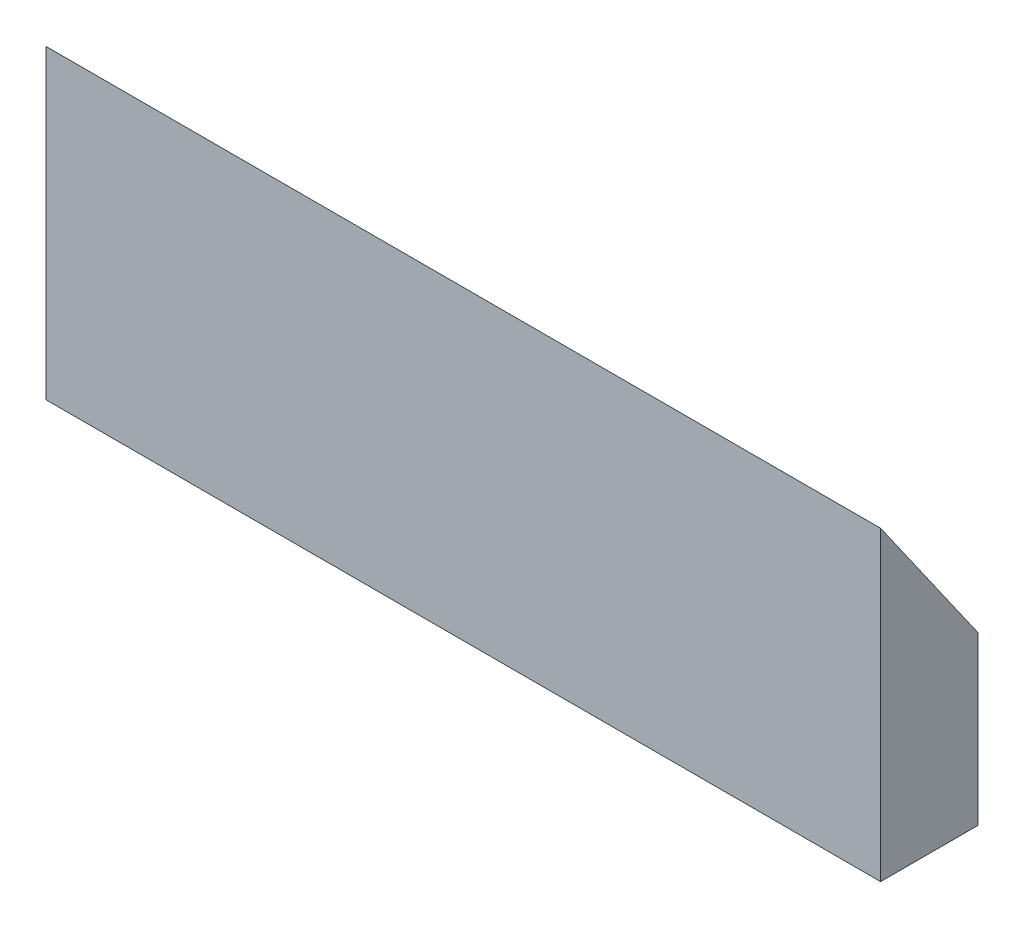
ISO-10303-21;
HEADER;
FILE_DESCRIPTION(('STEP AP214'),'2;1');
FILE_NAME('part.step','',(''),(''),'','','');
FILE_SCHEMA(('AUTOMOTIVE_DESIGN { 1 0 10303 214 1 1 1 1 }'));
ENDSEC;
DATA;
#1=APPLICATION_CONTEXT('core data for automotive mechanical design processes');
#2=APPLICATION_PROTOCOL_DEFINITION('international standard','automotive_design',2000,#1);
#3=PRODUCT_CONTEXT('',#1,'mechanical');
#4=PRODUCT('Part','Part','',(#3));
#5=PRODUCT_RELATED_PRODUCT_CATEGORY('part','',(#4));
#6=PRODUCT_DEFINITION_FORMATION('','',#4);
#7=PRODUCT_DEFINITION_CONTEXT('part definition',#1,'design');
#8=PRODUCT_DEFINITION('design','',#6,#7);
#9=PRODUCT_DEFINITION_SHAPE('','',#8);
#10=(LENGTH_UNIT() NAMED_UNIT(*) SI_UNIT(.MILLI.,.METRE.));
#11=(NAMED_UNIT(*) PLANE_ANGLE_UNIT() SI_UNIT($,.RADIAN.));
#12=(NAMED_UNIT(*) SI_UNIT($,.STERADIAN.) SOLID_ANGLE_UNIT());
#13=UNCERTAINTY_MEASURE_WITH_UNIT(LENGTH_MEASURE(1.E-05),#10,'distance_accuracy_value','');
#14=(GEOMETRIC_REPRESENTATION_CONTEXT(3) GLOBAL_UNCERTAINTY_ASSIGNED_CONTEXT((#13)) GLOBAL_UNIT_ASSIGNED_CONTEXT((#10,
#11,#12)) REPRESENTATION_CONTEXT('',''));
#15=CARTESIAN_POINT('',(0.,0.,0.));
#16=DIRECTION('',(0.,0.,1.));
#17=DIRECTION('',(1.,0.,0.));
#18=AXIS2_PLACEMENT_3D('',#15,#16,#17);
#19=CARTESIAN_POINT('',(0.,-0.6,0.35));
#20=DIRECTION('',(1.,0.,0.));
#21=DIRECTION('',(0.,1.,0.));
#22=AXIS2_PLACEMENT_3D('',#19,#20,#21);
#23=PLANE('',#22);
#24=DIRECTION('',(0.,-1.,0.));
#25=VECTOR('',#24,1.);
#26=CARTESIAN_POINT('',(0.,-0.6,0.));
#27=LINE('',#26,#25);
#28=CARTESIAN_POINT('',(0.,0.,0.));
#29=VERTEX_POINT('',#28);
#30=CARTESIAN_POINT('',(0.,-0.6,0.));
#31=VERTEX_POINT('',#30);
#32=EDGE_CURVE('E66',#29,#31,#27,.T.);
#33=ORIENTED_EDGE('',*,*,#32,.T.);
#34=DIRECTION('',(0.,0.,-1.));
#35=VECTOR('',#34,1.);
#36=CARTESIAN_POINT('',(0.,-0.6,0.35));
#37=LINE('',#36,#35);
#38=CARTESIAN_POINT('',(0.,-0.6,0.35));
#39=VERTEX_POINT('',#38);
#40=EDGE_CURVE('E11',#39,#31,#37,.T.);
#41=ORIENTED_EDGE('',*,*,#40,.F.);
#42=DIRECTION('',(0.,-1.,0.));
#43=VECTOR('',#42,1.);
#44=CARTESIAN_POINT('',(0.,-0.6,0.35));
#45=LINE('',#44,#43);
#46=CARTESIAN_POINT('',(0.,0.5,0.35));
#47=VERTEX_POINT('',#46);
#48=EDGE_CURVE('E90',#47,#39,#45,.T.);
#49=ORIENTED_EDGE('',*,*,#48,.F.);
#50=DIRECTION('',(0.,-0.81923192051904,-0.573462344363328));
#51=VECTOR('',#50,1.);
#52=CARTESIAN_POINT('',(0.,0.5,0.35));
#53=LINE('',#52,#51);
#54=EDGE_CURVE('E87',#47,#29,#53,.T.);
#55=ORIENTED_EDGE('',*,*,#54,.T.);
#56=EDGE_LOOP('',(#33,#41,#49,#55));
#57=FACE_BOUND('',#56,.T.);
#58=ADVANCED_FACE('F40',(#57),#23,.F.);
#59=CARTESIAN_POINT('',(3.,-0.6,0.35));
#60=DIRECTION('',(0.,1.,0.));
#61=DIRECTION('',(0.,0.,1.));
#62=AXIS2_PLACEMENT_3D('',#59,#60,#61);
#63=PLANE('',#62);
#64=DIRECTION('',(1.,0.,0.));
#65=VECTOR('',#64,1.);
#66=CARTESIAN_POINT('',(3.,-0.6,0.));
#67=LINE('',#66,#65);
#68=CARTESIAN_POINT('',(3.,-0.6,0.));
#69=VERTEX_POINT('',#68);
#70=EDGE_CURVE('E63',#31,#69,#67,.T.);
#71=ORIENTED_EDGE('',*,*,#70,.T.);
#72=DIRECTION('',(0.,0.,-1.));
#73=VECTOR('',#72,1.);
#74=CARTESIAN_POINT('',(3.,-0.6,0.35));
#75=LINE('',#74,#73);
#76=CARTESIAN_POINT('',(3.,-0.6,0.35));
#77=VERTEX_POINT('',#76);
#78=EDGE_CURVE('E44',#77,#69,#75,.T.);
#79=ORIENTED_EDGE('',*,*,#78,.F.);
#80=DIRECTION('',(1.,0.,0.));
#81=VECTOR('',#80,1.);
#82=CARTESIAN_POINT('',(3.,-0.6,0.35));
#83=LINE('',#82,#81);
#84=EDGE_CURVE('E52',#39,#77,#83,.T.);
#85=ORIENTED_EDGE('',*,*,#84,.F.);
#86=ORIENTED_EDGE('',*,*,#40,.T.);
#87=EDGE_LOOP('',(#71,#79,#85,#86));
#88=FACE_BOUND('',#87,.T.);
#89=ADVANCED_FACE('F110',(#88),#63,.F.);
#90=CARTESIAN_POINT('',(3.,0.,0.35));
#91=DIRECTION('',(-1.,0.,0.));
#92=DIRECTION('',(0.,-1.,0.));
#93=AXIS2_PLACEMENT_3D('',#90,#91,#92);
#94=PLANE('',#93);
#95=DIRECTION('',(0.,1.,0.));
#96=VECTOR('',#95,1.);
#97=CARTESIAN_POINT('',(3.,0.,0.));
#98=LINE('',#97,#96);
#99=CARTESIAN_POINT('',(3.,0.,0.));
#100=VERTEX_POINT('',#99);
#101=EDGE_CURVE('E89',#69,#100,#98,.T.);
#102=ORIENTED_EDGE('',*,*,#101,.T.);
#103=DIRECTION('',(0.,0.819231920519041,0.573462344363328));
#104=VECTOR('',#103,1.);
#105=CARTESIAN_POINT('',(3.,0.500000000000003,0.35));
#106=LINE('',#105,#104);
#107=CARTESIAN_POINT('',(3.,0.500000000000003,0.35));
#108=VERTEX_POINT('',#107);
#109=EDGE_CURVE('E78',#100,#108,#106,.T.);
#110=ORIENTED_EDGE('',*,*,#109,.T.);
#111=DIRECTION('',(0.,1.,0.));
#112=VECTOR('',#111,1.);
#113=CARTESIAN_POINT('',(3.,0.,0.35));
#114=LINE('',#113,#112);
#115=EDGE_CURVE('E101',#77,#108,#114,.T.);
#116=ORIENTED_EDGE('',*,*,#115,.F.);
#117=ORIENTED_EDGE('',*,*,#78,.T.);
#118=EDGE_LOOP('',(#102,#110,#116,#117));
#119=FACE_BOUND('',#118,.T.);
#120=ADVANCED_FACE('F106',(#119),#94,.F.);
#121=CARTESIAN_POINT('',(0.,0.,0.35));
#122=DIRECTION('',(0.,0.,-1.));
#123=DIRECTION('',(-1.,0.,0.));
#124=AXIS2_PLACEMENT_3D('',#121,#122,#123);
#125=PLANE('',#124);
#126=ORIENTED_EDGE('',*,*,#48,.T.);
#127=ORIENTED_EDGE('',*,*,#84,.T.);
#128=ORIENTED_EDGE('',*,*,#115,.T.);
#129=DIRECTION('',(-1.,0.,0.));
#130=VECTOR('',#129,1.);
#131=CARTESIAN_POINT('',(3.61032778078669,0.500000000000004,0.35));
#132=LINE('',#131,#130);
#133=EDGE_CURVE('E94',#108,#47,#132,.T.);
#134=ORIENTED_EDGE('',*,*,#133,.T.);
#135=EDGE_LOOP('',(#126,#127,#128,#134));
#136=FACE_BOUND('',#135,.T.);
#137=ADVANCED_FACE('F107',(#136),#125,.F.);
#138=CARTESIAN_POINT('',(0.,0.,0.));
#139=DIRECTION('',(0.,0.,-1.));
#140=DIRECTION('',(-1.,0.,0.));
#141=AXIS2_PLACEMENT_3D('',#138,#139,#140);
#142=PLANE('',#141);
#143=ORIENTED_EDGE('',*,*,#32,.F.);
#144=DIRECTION('',(-1.,0.,0.));
#145=VECTOR('',#144,1.);
#146=CARTESIAN_POINT('',(0.,0.,0.));
#147=LINE('',#146,#145);
#148=EDGE_CURVE('E74',#100,#29,#147,.T.);
#149=ORIENTED_EDGE('',*,*,#148,.F.);
#150=ORIENTED_EDGE('',*,*,#101,.F.);
#151=ORIENTED_EDGE('',*,*,#70,.F.);
#152=EDGE_LOOP('',(#143,#149,#150,#151));
#153=FACE_BOUND('',#152,.T.);
#154=ADVANCED_FACE('F75',(#153),#142,.T.);
#155=CARTESIAN_POINT('',(3.61032778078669,0.500000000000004,0.35));
#156=DIRECTION('',(0.,0.573462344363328,-0.81923192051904));
#157=DIRECTION('',(0.,0.819231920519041,0.573462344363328));
#158=AXIS2_PLACEMENT_3D('',#155,#156,#157);
#159=PLANE('',#158);
#160=ORIENTED_EDGE('',*,*,#109,.F.);
#161=ORIENTED_EDGE('',*,*,#148,.T.);
#162=ORIENTED_EDGE('',*,*,#54,.F.);
#163=ORIENTED_EDGE('',*,*,#133,.F.);
#164=EDGE_LOOP('',(#160,#161,#162,#163));
#165=FACE_BOUND('',#164,.T.);
#166=ADVANCED_FACE('F84',(#165),#159,.T.);
#167=CLOSED_SHELL('',(#58,#89,#120,#137,#154,#166));
#168=MANIFOLD_SOLID_BREP('B2',#167);
#169=ADVANCED_BREP_SHAPE_REPRESENTATION('',(#18,#168),#14);
#170=SHAPE_DEFINITION_REPRESENTATION(#9,#169);
ENDSEC;
END-ISO-10303-21;
